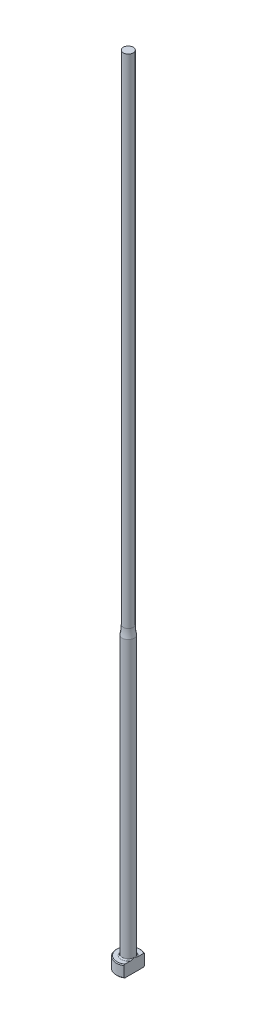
ISO-10303-21;
HEADER;
FILE_DESCRIPTION(('STEP AP214'),'2;1');
FILE_NAME('part.step','',(''),(''),'','','');
FILE_SCHEMA(('AUTOMOTIVE_DESIGN { 1 0 10303 214 1 1 1 1 }'));
ENDSEC;
DATA;
#1=APPLICATION_CONTEXT('core data for automotive mechanical design processes');
#2=APPLICATION_PROTOCOL_DEFINITION('international standard','automotive_design',2000,#1);
#3=PRODUCT_CONTEXT('',#1,'mechanical');
#4=PRODUCT('Part','Part','',(#3));
#5=PRODUCT_RELATED_PRODUCT_CATEGORY('part','',(#4));
#6=PRODUCT_DEFINITION_FORMATION('','',#4);
#7=PRODUCT_DEFINITION_CONTEXT('part definition',#1,'design');
#8=PRODUCT_DEFINITION('design','',#6,#7);
#9=PRODUCT_DEFINITION_SHAPE('','',#8);
#10=(LENGTH_UNIT() NAMED_UNIT(*) SI_UNIT(.MILLI.,.METRE.));
#11=(NAMED_UNIT(*) PLANE_ANGLE_UNIT() SI_UNIT($,.RADIAN.));
#12=(NAMED_UNIT(*) SI_UNIT($,.STERADIAN.) SOLID_ANGLE_UNIT());
#13=UNCERTAINTY_MEASURE_WITH_UNIT(LENGTH_MEASURE(1.E-05),#10,'distance_accuracy_value','');
#14=(GEOMETRIC_REPRESENTATION_CONTEXT(3) GLOBAL_UNCERTAINTY_ASSIGNED_CONTEXT((#13)) GLOBAL_UNIT_ASSIGNED_CONTEXT((#10,
#11,#12)) REPRESENTATION_CONTEXT('',''));
#15=CARTESIAN_POINT('',(0.,0.,0.));
#16=DIRECTION('',(0.,0.,1.));
#17=DIRECTION('',(1.,0.,0.));
#18=AXIS2_PLACEMENT_3D('',#15,#16,#17);
#19=CARTESIAN_POINT('',(-2.99999999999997,3.,0.));
#20=DIRECTION('',(0.,1.,0.));
#21=DIRECTION('',(0.,0.,1.));
#22=AXIS2_PLACEMENT_3D('',#19,#20,#21);
#23=PLANE('',#22);
#24=CARTESIAN_POINT('',(0.,3.,0.));
#25=DIRECTION('',(0.,1.,0.));
#26=DIRECTION('',(0.,0.,1.));
#27=AXIS2_PLACEMENT_3D('',#24,#25,#26);
#28=CIRCLE('',#27,2.79999999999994);
#29=CARTESIAN_POINT('',(1.49999999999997,3.,-2.36431808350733));
#30=VERTEX_POINT('',#29);
#31=CARTESIAN_POINT('',(1.49999999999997,3.,2.36431808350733));
#32=VERTEX_POINT('',#31);
#33=EDGE_CURVE('E187',#30,#32,#28,.T.);
#34=ORIENTED_EDGE('',*,*,#33,.T.);
#35=DIRECTION('',(0.,0.,-1.));
#36=VECTOR('',#35,1.);
#37=CARTESIAN_POINT('',(1.49999999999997,3.,0.));
#38=LINE('',#37,#36);
#39=CARTESIAN_POINT('',(1.49999999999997,3.00000000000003,0.99498743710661));
#40=VERTEX_POINT('',#39);
#41=EDGE_CURVE('E57',#32,#40,#38,.T.);
#42=ORIENTED_EDGE('',*,*,#41,.T.);
#43=CARTESIAN_POINT('',(0.,3.,0.));
#44=DIRECTION('',(0.,1.,0.));
#45=DIRECTION('',(0.,0.,1.));
#46=AXIS2_PLACEMENT_3D('',#43,#44,#45);
#47=CIRCLE('',#46,1.79999999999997);
#48=CARTESIAN_POINT('',(1.49999999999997,3.00000000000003,-0.994987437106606));
#49=VERTEX_POINT('',#48);
#50=EDGE_CURVE('E108',#40,#49,#47,.F.);
#51=ORIENTED_EDGE('',*,*,#50,.T.);
#52=EDGE_CURVE('E137',#49,#30,#38,.T.);
#53=ORIENTED_EDGE('',*,*,#52,.T.);
#54=EDGE_LOOP('',(#34,#42,#51,#53));
#55=FACE_BOUND('',#54,.T.);
#56=ADVANCED_FACE('F32',(#55),#23,.T.);
#57=CARTESIAN_POINT('',(0.,259.958771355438,0.));
#58=DIRECTION('',(0.,1.,0.));
#59=DIRECTION('',(0.,0.,1.));
#60=AXIS2_PLACEMENT_3D('',#57,#58,#59);
#61=CYLINDRICAL_SURFACE('',#60,2.99999999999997);
#62=CARTESIAN_POINT('',(0.,2.79999999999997,0.));
#63=DIRECTION('',(0.,1.,0.));
#64=DIRECTION('',(0.,0.,1.));
#65=AXIS2_PLACEMENT_3D('',#62,#63,#64);
#66=CIRCLE('',#65,2.99999999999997);
#67=CARTESIAN_POINT('',(1.49999999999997,2.79999999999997,2.5980762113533));
#68=VERTEX_POINT('',#67);
#69=CARTESIAN_POINT('',(1.49999999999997,2.79999999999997,-2.5980762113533));
#70=VERTEX_POINT('',#69);
#71=EDGE_CURVE('E105',#68,#70,#66,.F.);
#72=ORIENTED_EDGE('',*,*,#71,.T.);
#73=DIRECTION('',(0.,-1.,0.));
#74=VECTOR('',#73,1.);
#75=CARTESIAN_POINT('',(1.49999999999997,200.,-2.5980762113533));
#76=LINE('',#75,#74);
#77=CARTESIAN_POINT('',(1.49999999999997,0.200000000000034,-2.5980762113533));
#78=VERTEX_POINT('',#77);
#79=EDGE_CURVE('E193',#70,#78,#76,.T.);
#80=ORIENTED_EDGE('',*,*,#79,.T.);
#81=CARTESIAN_POINT('',(0.,0.200000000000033,0.));
#82=DIRECTION('',(0.,-1.,0.));
#83=DIRECTION('',(0.,0.,-1.));
#84=AXIS2_PLACEMENT_3D('',#81,#82,#83);
#85=CIRCLE('',#84,2.99999999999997);
#86=CARTESIAN_POINT('',(1.49999999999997,0.200000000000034,2.5980762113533));
#87=VERTEX_POINT('',#86);
#88=EDGE_CURVE('E100',#78,#87,#85,.F.);
#89=ORIENTED_EDGE('',*,*,#88,.T.);
#90=DIRECTION('',(0.,-1.,0.));
#91=VECTOR('',#90,1.);
#92=CARTESIAN_POINT('',(1.49999999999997,200.,2.5980762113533));
#93=LINE('',#92,#91);
#94=EDGE_CURVE('E93',#68,#87,#93,.T.);
#95=ORIENTED_EDGE('',*,*,#94,.F.);
#96=EDGE_LOOP('',(#72,#80,#89,#95));
#97=FACE_BOUND('',#96,.T.);
#98=ADVANCED_FACE('F158',(#97),#61,.T.);
#99=CARTESIAN_POINT('',(0.,0.,0.));
#100=DIRECTION('',(0.,-1.,0.));
#101=DIRECTION('',(0.,0.,-1.));
#102=AXIS2_PLACEMENT_3D('',#99,#100,#101);
#103=PLANE('',#102);
#104=CARTESIAN_POINT('',(0.,0.,0.));
#105=DIRECTION('',(0.,-1.,0.));
#106=DIRECTION('',(0.,0.,-1.));
#107=AXIS2_PLACEMENT_3D('',#104,#105,#106);
#108=CIRCLE('',#107,2.79999999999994);
#109=CARTESIAN_POINT('',(1.49999999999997,0.,2.36431808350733));
#110=VERTEX_POINT('',#109);
#111=CARTESIAN_POINT('',(1.49999999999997,0.,-2.36431808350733));
#112=VERTEX_POINT('',#111);
#113=EDGE_CURVE('E98',#110,#112,#108,.T.);
#114=ORIENTED_EDGE('',*,*,#113,.T.);
#115=DIRECTION('',(0.,0.,1.));
#116=VECTOR('',#115,1.);
#117=CARTESIAN_POINT('',(1.49999999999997,0.,-2.5980762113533));
#118=LINE('',#117,#116);
#119=EDGE_CURVE('E83',#112,#110,#118,.T.);
#120=ORIENTED_EDGE('',*,*,#119,.T.);
#121=EDGE_LOOP('',(#114,#120));
#122=FACE_BOUND('',#121,.T.);
#123=ADVANCED_FACE('F103',(#122),#103,.T.);
#124=CARTESIAN_POINT('',(0.,3.,0.));
#125=DIRECTION('',(0.,-1.,0.));
#126=DIRECTION('',(0.,0.,-1.));
#127=AXIS2_PLACEMENT_3D('',#124,#125,#126);
#128=CONICAL_SURFACE('',#127,2.79999999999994,0.785398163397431);
#129=ORIENTED_EDGE('',*,*,#71,.F.);
#130=CARTESIAN_POINT('',(1.49999999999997,-0.11174109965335,5.71827621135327));
#131=CARTESIAN_POINT('',(1.49999999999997,0.0136183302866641,5.58866816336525));
#132=CARTESIAN_POINT('',(1.49999999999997,0.138843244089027,5.45892957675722));
#133=CARTESIAN_POINT('',(1.49999999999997,0.388944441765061,5.19911365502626));
#134=CARTESIAN_POINT('',(1.49999999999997,0.513820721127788,5.06903631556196));
#135=CARTESIAN_POINT('',(1.49999999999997,0.763205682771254,4.80840180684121));
#136=CARTESIAN_POINT('',(1.49999999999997,0.887714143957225,4.67784442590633));
#137=CARTESIAN_POINT('',(1.49999999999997,1.13618059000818,4.4162081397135));
#138=CARTESIAN_POINT('',(1.49999999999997,1.26013857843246,4.28512923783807));
#139=CARTESIAN_POINT('',(1.49999999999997,1.50488975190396,4.02490837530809));
#140=CARTESIAN_POINT('',(1.49999999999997,1.62569693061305,3.8957795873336));
#141=CARTESIAN_POINT('',(1.49999999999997,1.86640694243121,3.63668213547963));
#142=CARTESIAN_POINT('',(1.49999999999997,1.98630978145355,3.50671347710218));
#143=CARTESIAN_POINT('',(1.49999999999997,2.2248603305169,3.24567921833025));
#144=CARTESIAN_POINT('',(1.49999999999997,2.3435083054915,3.11461386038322));
#145=CARTESIAN_POINT('',(1.49999999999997,2.5790771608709,2.85094268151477));
#146=CARTESIAN_POINT('',(1.49999999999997,2.69599811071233,2.71833692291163));
#147=CARTESIAN_POINT('',(1.49999999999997,2.88262371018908,2.50255231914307));
#148=CARTESIAN_POINT('',(1.49999999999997,2.95312454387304,2.42006293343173));
#149=CARTESIAN_POINT('',(1.49999999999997,3.09287098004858,2.25401084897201));
#150=CARTESIAN_POINT('',(1.49999999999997,3.16211645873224,2.17044804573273));
#151=CARTESIAN_POINT('',(1.49999999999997,3.29964684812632,2.00105967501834));
#152=CARTESIAN_POINT('',(1.49999999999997,3.36791386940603,1.9152195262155));
#153=CARTESIAN_POINT('',(1.49999999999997,3.50205840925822,1.7417139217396));
#154=CARTESIAN_POINT('',(1.49999999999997,3.56793649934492,1.65404891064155));
#155=CARTESIAN_POINT('',(1.49999999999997,3.69728151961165,1.47490236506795));
#156=CARTESIAN_POINT('',(1.49999999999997,3.76069661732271,1.38338308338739));
#157=CARTESIAN_POINT('',(1.49999999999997,3.88239539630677,1.19675661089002));
#158=CARTESIAN_POINT('',(1.49999999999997,3.94067201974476,1.10164473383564));
#159=CARTESIAN_POINT('',(1.49999999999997,4.048413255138,0.908008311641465));
#160=CARTESIAN_POINT('',(1.49999999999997,4.09797809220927,0.809540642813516));
#161=CARTESIAN_POINT('',(1.49999999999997,4.18432188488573,0.60719295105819));
#162=CARTESIAN_POINT('',(1.49999999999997,4.22114374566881,0.503332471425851));
#163=CARTESIAN_POINT('',(1.49999999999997,4.26099935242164,0.3475775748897));
#164=CARTESIAN_POINT('',(1.49999999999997,4.2715702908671,0.297609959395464));
#165=CARTESIAN_POINT('',(1.49999999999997,4.28794860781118,0.196885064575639));
#166=CARTESIAN_POINT('',(1.49999999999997,4.29375640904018,0.146127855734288));
#167=CARTESIAN_POINT('',(1.49999999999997,4.30019707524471,0.0444388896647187));
#168=CARTESIAN_POINT('',(1.49999999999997,4.30084594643,-0.00649183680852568));
#169=CARTESIAN_POINT('',(1.49999999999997,4.29696416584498,-0.108155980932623));
#170=CARTESIAN_POINT('',(1.49999999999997,4.29243308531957,-0.158889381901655));
#171=CARTESIAN_POINT('',(1.49999999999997,4.27856915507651,-0.259234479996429));
#172=CARTESIAN_POINT('',(1.49999999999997,4.2692782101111,-0.308852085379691));
#173=CARTESIAN_POINT('',(1.49999999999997,4.24647108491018,-0.407110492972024));
#174=CARTESIAN_POINT('',(1.49999999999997,4.23295324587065,-0.45575090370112));
#175=CARTESIAN_POINT('',(1.49999999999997,4.20226175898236,-0.55214996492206));
#176=CARTESIAN_POINT('',(1.49999999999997,4.18506801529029,-0.599902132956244));
#177=CARTESIAN_POINT('',(1.49999999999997,4.14771387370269,-0.694205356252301));
#178=CARTESIAN_POINT('',(1.49999999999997,4.12755408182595,-0.740756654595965));
#179=CARTESIAN_POINT('',(1.49999999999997,4.0632769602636,-0.879166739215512));
#180=CARTESIAN_POINT('',(1.49999999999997,4.01551721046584,-0.969329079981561));
#181=CARTESIAN_POINT('',(1.49999999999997,3.91367909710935,-1.14604316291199));
#182=CARTESIAN_POINT('',(1.49999999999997,3.85959300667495,-1.2325903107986));
#183=CARTESIAN_POINT('',(1.49999999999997,3.74697968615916,-1.40321348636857));
#184=CARTESIAN_POINT('',(1.49999999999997,3.68843573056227,-1.4872783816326));
#185=CARTESIAN_POINT('',(1.49999999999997,3.5684384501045,-1.65322187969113));
#186=CARTESIAN_POINT('',(1.49999999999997,3.50698656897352,-1.73510153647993));
#187=CARTESIAN_POINT('',(1.49999999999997,3.3811567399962,-1.89829823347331));
#188=CARTESIAN_POINT('',(1.49999999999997,3.31675092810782,-1.97959369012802));
#189=CARTESIAN_POINT('',(1.49999999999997,3.18634068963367,-2.14090082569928));
#190=CARTESIAN_POINT('',(1.49999999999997,3.12033609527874,-2.22091236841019));
#191=CARTESIAN_POINT('',(1.49999999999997,2.92086431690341,-2.45906508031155));
#192=CARTESIAN_POINT('',(1.49999999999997,2.78562663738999,-2.61572090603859));
#193=CARTESIAN_POINT('',(1.49999999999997,2.53554498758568,-2.90006295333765));
#194=CARTESIAN_POINT('',(1.49999999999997,2.42114543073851,-3.02814382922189));
#195=CARTESIAN_POINT('',(1.49999999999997,2.1909355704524,-3.28303767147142));
#196=CARTESIAN_POINT('',(1.49999999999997,2.07512522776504,-3.40985060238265));
#197=CARTESIAN_POINT('',(1.49999999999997,1.72597067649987,-3.78913849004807));
#198=CARTESIAN_POINT('',(1.49999999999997,1.49111760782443,-4.04022177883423));
#199=CARTESIAN_POINT('',(1.49999999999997,1.0288247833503,-4.52992803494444));
#200=CARTESIAN_POINT('',(1.49999999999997,0.801477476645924,-4.76863870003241));
#201=CARTESIAN_POINT('',(1.49999999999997,0.459548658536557,-5.12558036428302));
#202=CARTESIAN_POINT('',(1.49999999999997,0.345484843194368,-5.24430773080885));
#203=CARTESIAN_POINT('',(1.49999999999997,0.117071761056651,-5.48148573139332));
#204=CARTESIAN_POINT('',(1.49999999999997,0.00272249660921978,-5.59993636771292));
#205=CARTESIAN_POINT('',(1.49999999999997,-0.11174109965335,-5.71827621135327));
#206=B_SPLINE_CURVE_WITH_KNOTS('',3,(#130,#131,#132,#133,#134,#135,#136,#137,#138,#139,#140,
#141,#142,#143,#144,#145,#146,#147,#148,#149,#150,#151,#152,#153,#154,#155,#156,#157,#158,#159,
#160,#161,#162,#163,#164,#165,#166,#167,#168,#169,#170,#171,#172,#173,#174,#175,#176,#177,#178,
#179,#180,#181,#182,#183,#184,#185,#186,#187,#188,#189,#190,#191,#192,#193,#194,#195,#196,#197,
#198,#199,#200,#201,#202,#203,#204,#205),.UNSPECIFIED.,.F.,.F.,(4,2,2,2,2,2,2,2,2,2,2,2,2,2,2,2,
2,2,2,2,2,2,2,2,2,2,2,2,2,2,2,2,2,2,2,2,2,4),(0.,0.540943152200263,1.08189327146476,
1.62312052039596,2.16434426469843,2.69482920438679,3.22531067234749,3.75567781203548,
4.28602356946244,4.61155053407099,4.9371094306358,5.26610945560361,5.59503024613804,
5.92894782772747,6.26331713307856,6.59354403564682,6.92264800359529,7.07567478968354,
7.2286879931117,7.38122626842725,7.53377717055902,7.6850075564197,7.83629736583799,
7.98843643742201,8.14054446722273,8.44618799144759,8.75220879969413,9.05944044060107,
9.3665211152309,9.6776428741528,9.98879742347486,10.609592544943,11.1247803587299,
11.6399825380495,12.6713544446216,13.6603005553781,14.1542238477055,14.6481430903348),.UNSPECIFIED.);
#207=EDGE_CURVE('E136',#68,#32,#206,.T.);
#208=ORIENTED_EDGE('',*,*,#207,.T.);
#209=ORIENTED_EDGE('',*,*,#33,.F.);
#210=EDGE_CURVE('E128',#30,#70,#206,.T.);
#211=ORIENTED_EDGE('',*,*,#210,.T.);
#212=EDGE_LOOP('',(#129,#208,#209,#211));
#213=FACE_BOUND('',#212,.T.);
#214=ADVANCED_FACE('F144',(#213),#128,.T.);
#215=CARTESIAN_POINT('',(0.,0.200000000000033,0.));
#216=DIRECTION('',(0.,1.,0.));
#217=DIRECTION('',(0.,0.,1.));
#218=AXIS2_PLACEMENT_3D('',#215,#216,#217);
#219=CONICAL_SURFACE('',#218,2.99999999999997,0.785398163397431);
#220=ORIENTED_EDGE('',*,*,#88,.F.);
#221=CARTESIAN_POINT('',(1.49999999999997,3.11174109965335,-5.71827621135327));
#222=CARTESIAN_POINT('',(1.49999999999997,2.98638166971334,-5.58866816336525));
#223=CARTESIAN_POINT('',(1.49999999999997,2.86115675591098,-5.45892957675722));
#224=CARTESIAN_POINT('',(1.49999999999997,2.61105555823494,-5.19911365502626));
#225=CARTESIAN_POINT('',(1.49999999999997,2.48617927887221,-5.06903631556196));
#226=CARTESIAN_POINT('',(1.49999999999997,2.23679431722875,-4.80840180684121));
#227=CARTESIAN_POINT('',(1.49999999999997,2.11228585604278,-4.67784442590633));
#228=CARTESIAN_POINT('',(1.49999999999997,1.86381940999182,-4.4162081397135));
#229=CARTESIAN_POINT('',(1.49999999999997,1.73986142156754,-4.28512923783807));
#230=CARTESIAN_POINT('',(1.49999999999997,1.49511024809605,-4.02490837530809));
#231=CARTESIAN_POINT('',(1.49999999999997,1.37430306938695,-3.8957795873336));
#232=CARTESIAN_POINT('',(1.49999999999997,1.13359305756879,-3.63668213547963));
#233=CARTESIAN_POINT('',(1.49999999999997,1.01369021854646,-3.50671347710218));
#234=CARTESIAN_POINT('',(1.49999999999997,0.775139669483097,-3.24567921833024));
#235=CARTESIAN_POINT('',(1.49999999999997,0.656491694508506,-3.11461386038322));
#236=CARTESIAN_POINT('',(1.49999999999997,0.420922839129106,-2.85094268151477));
#237=CARTESIAN_POINT('',(1.49999999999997,0.304001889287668,-2.71833692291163));
#238=CARTESIAN_POINT('',(1.49999999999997,0.117376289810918,-2.50255231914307));
#239=CARTESIAN_POINT('',(1.49999999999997,0.0468754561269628,-2.42006293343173));
#240=CARTESIAN_POINT('',(1.49999999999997,-0.0928709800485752,-2.254010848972));
#241=CARTESIAN_POINT('',(1.49999999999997,-0.162116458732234,-2.17044804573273));
#242=CARTESIAN_POINT('',(1.49999999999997,-0.299646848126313,-2.00105967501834));
#243=CARTESIAN_POINT('',(1.49999999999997,-0.367913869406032,-1.9152195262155));
#244=CARTESIAN_POINT('',(1.49999999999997,-0.502058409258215,-1.7417139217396));
#245=CARTESIAN_POINT('',(1.49999999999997,-0.567936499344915,-1.65404891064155));
#246=CARTESIAN_POINT('',(1.49999999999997,-0.697281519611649,-1.47490236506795));
#247=CARTESIAN_POINT('',(1.49999999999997,-0.760696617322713,-1.38338308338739));
#248=CARTESIAN_POINT('',(1.49999999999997,-0.882395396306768,-1.19675661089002));
#249=CARTESIAN_POINT('',(1.49999999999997,-0.940672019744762,-1.10164473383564));
#250=CARTESIAN_POINT('',(1.49999999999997,-1.04841325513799,-0.908008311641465));
#251=CARTESIAN_POINT('',(1.49999999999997,-1.09797809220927,-0.809540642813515));
#252=CARTESIAN_POINT('',(1.49999999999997,-1.18432188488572,-0.607192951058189));
#253=CARTESIAN_POINT('',(1.49999999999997,-1.22114374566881,-0.503332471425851));
#254=CARTESIAN_POINT('',(1.49999999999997,-1.26099935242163,-0.3475775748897));
#255=CARTESIAN_POINT('',(1.49999999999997,-1.2715702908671,-0.297609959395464));
#256=CARTESIAN_POINT('',(1.49999999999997,-1.28794860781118,-0.19688506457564));
#257=CARTESIAN_POINT('',(1.49999999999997,-1.29375640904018,-0.146127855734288));
#258=CARTESIAN_POINT('',(1.49999999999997,-1.30019707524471,-0.0444388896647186));
#259=CARTESIAN_POINT('',(1.49999999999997,-1.30084594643,0.00649183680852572));
#260=CARTESIAN_POINT('',(1.49999999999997,-1.29696416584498,0.108155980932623));
#261=CARTESIAN_POINT('',(1.49999999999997,-1.29243308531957,0.158889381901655));
#262=CARTESIAN_POINT('',(1.49999999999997,-1.2785691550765,0.259234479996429));
#263=CARTESIAN_POINT('',(1.49999999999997,-1.2692782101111,0.308852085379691));
#264=CARTESIAN_POINT('',(1.49999999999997,-1.24647108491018,0.407110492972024));
#265=CARTESIAN_POINT('',(1.49999999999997,-1.23295324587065,0.45575090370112));
#266=CARTESIAN_POINT('',(1.49999999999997,-1.20226175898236,0.55214996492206));
#267=CARTESIAN_POINT('',(1.49999999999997,-1.18506801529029,0.599902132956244));
#268=CARTESIAN_POINT('',(1.49999999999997,-1.14771387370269,0.694205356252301));
#269=CARTESIAN_POINT('',(1.49999999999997,-1.12755408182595,0.740756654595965));
#270=CARTESIAN_POINT('',(1.49999999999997,-1.0632769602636,0.879166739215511));
#271=CARTESIAN_POINT('',(1.49999999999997,-1.01551721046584,0.96932907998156));
#272=CARTESIAN_POINT('',(1.49999999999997,-0.913679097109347,1.14604316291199));
#273=CARTESIAN_POINT('',(1.49999999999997,-0.85959300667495,1.2325903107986));
#274=CARTESIAN_POINT('',(1.49999999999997,-0.74697968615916,1.40321348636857));
#275=CARTESIAN_POINT('',(1.49999999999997,-0.688435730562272,1.4872783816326));
#276=CARTESIAN_POINT('',(1.49999999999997,-0.568438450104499,1.65322187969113));
#277=CARTESIAN_POINT('',(1.49999999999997,-0.50698656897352,1.73510153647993));
#278=CARTESIAN_POINT('',(1.49999999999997,-0.381156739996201,1.89829823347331));
#279=CARTESIAN_POINT('',(1.49999999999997,-0.316750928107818,1.97959369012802));
#280=CARTESIAN_POINT('',(1.49999999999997,-0.186340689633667,2.14090082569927));
#281=CARTESIAN_POINT('',(1.49999999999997,-0.120336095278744,2.22091236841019));
#282=CARTESIAN_POINT('',(1.49999999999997,0.0791356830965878,2.45906508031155));
#283=CARTESIAN_POINT('',(1.49999999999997,0.214373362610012,2.61572090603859));
#284=CARTESIAN_POINT('',(1.49999999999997,0.464455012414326,2.90006295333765));
#285=CARTESIAN_POINT('',(1.49999999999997,0.578854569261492,3.02814382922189));
#286=CARTESIAN_POINT('',(1.49999999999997,0.809064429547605,3.28303767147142));
#287=CARTESIAN_POINT('',(1.49999999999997,0.924874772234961,3.40985060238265));
#288=CARTESIAN_POINT('',(1.49999999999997,1.27402932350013,3.78913849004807));
#289=CARTESIAN_POINT('',(1.49999999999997,1.50888239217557,4.04022177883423));
#290=CARTESIAN_POINT('',(1.49999999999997,1.97117521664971,4.52992803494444));
#291=CARTESIAN_POINT('',(1.49999999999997,2.19852252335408,4.76863870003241));
#292=CARTESIAN_POINT('',(1.49999999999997,2.54045134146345,5.12558036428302));
#293=CARTESIAN_POINT('',(1.49999999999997,2.65451515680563,5.24430773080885));
#294=CARTESIAN_POINT('',(1.49999999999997,2.88292823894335,5.48148573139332));
#295=CARTESIAN_POINT('',(1.49999999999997,2.99727750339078,5.59993636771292));
#296=CARTESIAN_POINT('',(1.49999999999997,3.11174109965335,5.71827621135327));
#297=B_SPLINE_CURVE_WITH_KNOTS('',3,(#221,#222,#223,#224,#225,#226,#227,#228,#229,#230,#231,
#232,#233,#234,#235,#236,#237,#238,#239,#240,#241,#242,#243,#244,#245,#246,#247,#248,#249,#250,
#251,#252,#253,#254,#255,#256,#257,#258,#259,#260,#261,#262,#263,#264,#265,#266,#267,#268,#269,
#270,#271,#272,#273,#274,#275,#276,#277,#278,#279,#280,#281,#282,#283,#284,#285,#286,#287,#288,
#289,#290,#291,#292,#293,#294,#295,#296),.UNSPECIFIED.,.F.,.F.,(4,2,2,2,2,2,2,2,2,2,2,2,2,2,2,2,
2,2,2,2,2,2,2,2,2,2,2,2,2,2,2,2,2,2,2,2,2,4),(0.,0.540943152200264,1.08189327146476,
1.62312052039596,2.16434426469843,2.69482920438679,3.22531067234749,3.75567781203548,
4.28602356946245,4.611550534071,4.9371094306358,5.26610945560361,5.59503024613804,
5.92894782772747,6.26331713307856,6.59354403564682,6.92264800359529,7.07567478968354,
7.2286879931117,7.38122626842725,7.53377717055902,7.6850075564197,7.83629736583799,
7.98843643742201,8.14054446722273,8.44618799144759,8.75220879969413,9.05944044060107,
9.3665211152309,9.6776428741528,9.98879742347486,10.609592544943,11.1247803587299,
11.6399825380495,12.6713544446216,13.6603005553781,14.1542238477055,14.6481430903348),.UNSPECIFIED.);
#298=EDGE_CURVE('E86',#78,#112,#297,.T.);
#299=ORIENTED_EDGE('',*,*,#298,.T.);
#300=ORIENTED_EDGE('',*,*,#113,.F.);
#301=EDGE_CURVE('E89',#110,#87,#297,.T.);
#302=ORIENTED_EDGE('',*,*,#301,.T.);
#303=EDGE_LOOP('',(#220,#299,#300,#302));
#304=FACE_BOUND('',#303,.T.);
#305=ADVANCED_FACE('F97',(#304),#219,.T.);
#306=CARTESIAN_POINT('',(0.,3.30000000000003,0.));
#307=DIRECTION('',(0.,1.,0.));
#308=DIRECTION('',(0.,0.,1.));
#309=AXIS2_PLACEMENT_3D('',#306,#307,#308);
#310=TOROIDAL_SURFACE('',#309,1.79999999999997,0.3);
#311=CARTESIAN_POINT('',(1.49999999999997,3.30000000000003,0.));
#312=CARTESIAN_POINT('',(1.49999999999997,3.300000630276,3.41555678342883E-12));
#313=CARTESIAN_POINT('',(1.49999999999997,3.30000126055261,-1.15373640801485E-07));
#314=CARTESIAN_POINT('',(1.49999999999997,3.3000024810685,-4.90631575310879E-07));
#315=CARTESIAN_POINT('',(1.49999999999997,3.30000307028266,-7.53296670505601E-07));
#316=CARTESIAN_POINT('',(1.49999999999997,3.30000424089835,-1.38757096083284E-06));
#317=CARTESIAN_POINT('',(1.49999999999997,3.300004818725,-1.76563001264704E-06));
#318=CARTESIAN_POINT('',(1.49999999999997,3.30000591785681,-2.58768006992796E-06));
#319=CARTESIAN_POINT('',(1.49999999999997,3.30000643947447,-3.03127014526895E-06));
#320=CARTESIAN_POINT('',(1.49999999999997,3.30000815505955,-4.60021967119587E-06));
#321=CARTESIAN_POINT('',(1.49999999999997,3.30000927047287,-5.8124152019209E-06));
#322=CARTESIAN_POINT('',(1.49999999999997,3.30001128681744,-8.33989413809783E-06));
#323=CARTESIAN_POINT('',(1.49999999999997,3.30001219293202,-9.65128157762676E-06));
#324=CARTESIAN_POINT('',(1.49999999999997,3.30001551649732,-1.46782505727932E-05));
#325=CARTESIAN_POINT('',(1.49999999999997,3.30001775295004,-1.8517976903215E-05));
#326=CARTESIAN_POINT('',(1.49999999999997,3.30002148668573,-2.61616194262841E-05));
#327=CARTESIAN_POINT('',(1.49999999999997,3.30002302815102,-2.99447742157E-05));
#328=CARTESIAN_POINT('',(1.49999999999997,3.30002943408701,-4.58003743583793E-05));
#329=CARTESIAN_POINT('',(1.49999999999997,3.3000341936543,-5.79079078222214E-05));
#330=CARTESIAN_POINT('',(1.49999999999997,3.30004197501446,-8.07263755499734E-05));
#331=CARTESIAN_POINT('',(1.49999999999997,3.30004514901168,-9.13834709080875E-05));
#332=CARTESIAN_POINT('',(1.49999999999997,3.30006989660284,-0.000167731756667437));
#333=CARTESIAN_POINT('',(1.49999999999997,3.30010092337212,-0.000229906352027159));
#334=CARTESIAN_POINT('',(1.49999999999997,3.30021632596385,-0.000470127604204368));
#335=CARTESIAN_POINT('',(1.49999999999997,3.30029368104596,-0.000650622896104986));
#336=CARTESIAN_POINT('',(1.49999999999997,3.30059619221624,-0.00134589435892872));
#337=CARTESIAN_POINT('',(1.49999999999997,3.30082870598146,-0.00185814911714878));
#338=CARTESIAN_POINT('',(1.49999999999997,3.30176696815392,-0.00393547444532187));
#339=CARTESIAN_POINT('',(1.49999999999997,3.30246445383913,-0.00550332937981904));
#340=CARTESIAN_POINT('',(1.49999999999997,3.31426785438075,-0.0320229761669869));
#341=CARTESIAN_POINT('',(1.49999999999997,3.32544800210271,-0.0569503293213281));
#342=CARTESIAN_POINT('',(1.49999999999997,3.34725700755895,-0.105984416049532));
#343=CARTESIAN_POINT('',(1.49999999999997,3.35789134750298,-0.130088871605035));
#344=CARTESIAN_POINT('',(1.49999999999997,3.38015321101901,-0.181096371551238));
#345=CARTESIAN_POINT('',(1.49999999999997,3.39175804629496,-0.208009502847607));
#346=CARTESIAN_POINT('',(1.49999999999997,3.41469034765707,-0.262264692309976));
#347=CARTESIAN_POINT('',(1.49999999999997,3.42601398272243,-0.289608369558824));
#348=CARTESIAN_POINT('',(1.49999999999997,3.45363212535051,-0.35820378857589));
#349=CARTESIAN_POINT('',(1.49999999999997,3.46959026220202,-0.39959288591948));
#350=CARTESIAN_POINT('',(1.49999999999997,3.49940505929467,-0.482097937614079));
#351=CARTESIAN_POINT('',(1.49999999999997,3.51330033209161,-0.523199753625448));
#352=CARTESIAN_POINT('',(1.49999999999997,3.53552507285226,-0.595497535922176));
#353=CARTESIAN_POINT('',(1.49999999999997,3.54436834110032,-0.626532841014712));
#354=CARTESIAN_POINT('',(1.49999999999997,3.56052427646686,-0.6891760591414));
#355=CARTESIAN_POINT('',(1.49999999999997,3.5678279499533,-0.720786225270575));
#356=CARTESIAN_POINT('',(1.49999999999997,3.5875075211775,-0.819524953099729));
#357=CARTESIAN_POINT('',(1.49999999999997,3.59661044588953,-0.88742909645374));
#358=CARTESIAN_POINT('',(1.49999999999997,3.60059842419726,-0.991180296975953));
#359=CARTESIAN_POINT('',(1.49999999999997,3.60019840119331,-1.02684364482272));
#360=CARTESIAN_POINT('',(1.49999999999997,3.59497085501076,-1.097505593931));
#361=CARTESIAN_POINT('',(1.49999999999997,3.59019295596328,-1.13250716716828));
#362=CARTESIAN_POINT('',(1.49999999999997,3.57687734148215,-1.19353096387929));
#363=CARTESIAN_POINT('',(1.49999999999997,3.56943875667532,-1.21978854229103));
#364=CARTESIAN_POINT('',(1.49999999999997,3.55063748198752,-1.27094658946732));
#365=CARTESIAN_POINT('',(1.49999999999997,3.53927342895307,-1.29584658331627));
#366=CARTESIAN_POINT('',(1.49999999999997,3.51660016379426,-1.33501873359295));
#367=CARTESIAN_POINT('',(1.49999999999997,3.50657738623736,-1.35003296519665));
#368=CARTESIAN_POINT('',(1.49999999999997,3.48437469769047,-1.37837252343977));
#369=CARTESIAN_POINT('',(1.49999999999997,3.47219867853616,-1.39170082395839));
#370=CARTESIAN_POINT('',(1.49999999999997,3.44835614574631,-1.41349417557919));
#371=CARTESIAN_POINT('',(1.49999999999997,3.43709185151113,-1.42239673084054));
#372=CARTESIAN_POINT('',(1.49999999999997,3.41325256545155,-1.43825467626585));
#373=CARTESIAN_POINT('',(1.49999999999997,3.40067804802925,-1.44521076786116));
#374=CARTESIAN_POINT('',(1.49999999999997,3.37433767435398,-1.45677158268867));
#375=CARTESIAN_POINT('',(1.49999999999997,3.36056203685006,-1.46135438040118));
#376=CARTESIAN_POINT('',(1.49999999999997,3.33237324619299,-1.46767730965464));
#377=CARTESIAN_POINT('',(1.49999999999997,3.31796076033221,-1.46942034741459));
#378=CARTESIAN_POINT('',(1.49999999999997,3.29122479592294,-1.4698720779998));
#379=CARTESIAN_POINT('',(1.49999999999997,3.27890664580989,-1.468990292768));
#380=CARTESIAN_POINT('',(1.49999999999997,3.25461019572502,-1.4651157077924));
#381=CARTESIAN_POINT('',(1.49999999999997,3.2426318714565,-1.46212305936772));
#382=CARTESIAN_POINT('',(1.49999999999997,3.21959683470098,-1.4543117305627));
#383=CARTESIAN_POINT('',(1.49999999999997,3.20852542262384,-1.44953579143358));
#384=CARTESIAN_POINT('',(1.49999999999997,3.18721125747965,-1.43840957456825));
#385=CARTESIAN_POINT('',(1.49999999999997,3.1769687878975,-1.43205876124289));
#386=CARTESIAN_POINT('',(1.49999999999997,3.15325976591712,-1.41506353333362));
#387=CARTESIAN_POINT('',(1.49999999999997,3.14027750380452,-1.40374235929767));
#388=CARTESIAN_POINT('',(1.49999999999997,3.11630720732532,-1.37914825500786));
#389=CARTESIAN_POINT('',(1.49999999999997,3.10532420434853,-1.36587054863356));
#390=CARTESIAN_POINT('',(1.49999999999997,3.08100891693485,-1.33197272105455));
#391=CARTESIAN_POINT('',(1.49999999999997,3.06867625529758,-1.31063843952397));
#392=CARTESIAN_POINT('',(1.49999999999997,3.04751867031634,-1.26637455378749));
#393=CARTESIAN_POINT('',(1.49999999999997,3.03869240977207,-1.24344556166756));
#394=CARTESIAN_POINT('',(1.49999999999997,3.01978360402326,-1.18316534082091));
#395=CARTESIAN_POINT('',(1.49999999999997,3.01191472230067,-1.14512623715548));
#396=CARTESIAN_POINT('',(1.49999999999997,3.00188285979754,-1.06789971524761));
#397=CARTESIAN_POINT('',(1.49999999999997,2.99979735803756,-1.02870374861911));
#398=CARTESIAN_POINT('',(1.49999999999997,3.00021727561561,-0.953160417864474));
#399=CARTESIAN_POINT('',(1.49999999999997,3.00240673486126,-0.916808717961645));
#400=CARTESIAN_POINT('',(1.49999999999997,3.0099643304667,-0.844432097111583));
#401=CARTESIAN_POINT('',(1.49999999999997,3.01533462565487,-0.808407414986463));
#402=CARTESIAN_POINT('',(1.49999999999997,3.02828086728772,-0.738670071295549));
#403=CARTESIAN_POINT('',(1.49999999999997,3.03573028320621,-0.704933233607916));
#404=CARTESIAN_POINT('',(1.49999999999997,3.05243174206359,-0.638128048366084));
#405=CARTESIAN_POINT('',(1.49999999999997,3.06167285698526,-0.605056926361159));
#406=CARTESIAN_POINT('',(1.49999999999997,3.08440652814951,-0.53019513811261));
#407=CARTESIAN_POINT('',(1.49999999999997,3.09836576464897,-0.488547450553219));
#408=CARTESIAN_POINT('',(1.49999999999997,3.1283820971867,-0.404954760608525));
#409=CARTESIAN_POINT('',(1.49999999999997,3.14447968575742,-0.363024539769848));
#410=CARTESIAN_POINT('',(1.49999999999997,3.17238454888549,-0.293508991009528));
#411=CARTESIAN_POINT('',(1.49999999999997,3.18384249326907,-0.265781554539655));
#412=CARTESIAN_POINT('',(1.49999999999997,3.20705854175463,-0.210769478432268));
#413=CARTESIAN_POINT('',(1.49999999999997,3.21881265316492,-0.183483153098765));
#414=CARTESIAN_POINT('',(1.49999999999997,3.24136702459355,-0.131772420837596));
#415=CARTESIAN_POINT('',(1.49999999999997,3.25214361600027,-0.107337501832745));
#416=CARTESIAN_POINT('',(1.49999999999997,3.27424746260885,-0.0576321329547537));
#417=CARTESIAN_POINT('',(1.49999999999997,3.28558038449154,-0.0323640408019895));
#418=CARTESIAN_POINT('',(1.49999999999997,3.29753556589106,-0.00550327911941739));
#419=CARTESIAN_POINT('',(1.49999999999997,3.29823307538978,-0.00393537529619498));
#420=CARTESIAN_POINT('',(1.49999999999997,3.29917134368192,-0.00185803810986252));
#421=CARTESIAN_POINT('',(1.49999999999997,3.29940384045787,-0.00134582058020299));
#422=CARTESIAN_POINT('',(1.49999999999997,3.29970633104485,-0.000650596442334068));
#423=CARTESIAN_POINT('',(1.49999999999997,3.29978368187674,-0.000470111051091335));
#424=CARTESIAN_POINT('',(1.49999999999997,3.29989907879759,-0.000229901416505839));
#425=CARTESIAN_POINT('',(1.49999999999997,3.29993010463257,-0.000167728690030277));
#426=CARTESIAN_POINT('',(1.49999999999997,3.29995485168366,-9.13825689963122E-05));
#427=CARTESIAN_POINT('',(1.49999999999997,3.29995802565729,-8.07256241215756E-05));
#428=CARTESIAN_POINT('',(1.49999999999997,3.29996580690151,-5.79074820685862E-05));
#429=CARTESIAN_POINT('',(1.49999999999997,3.29997056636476,-4.5800119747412E-05));
#430=CARTESIAN_POINT('',(1.49999999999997,3.29997697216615,-2.99447119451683E-05));
#431=CARTESIAN_POINT('',(1.49999999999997,3.2999785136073,-2.61615817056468E-05));
#432=CARTESIAN_POINT('',(1.49999999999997,3.2999822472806,-1.85179845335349E-05));
#433=CARTESIAN_POINT('',(1.49999999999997,3.29998448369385,-1.46782782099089E-05));
#434=CARTESIAN_POINT('',(1.49999999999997,3.2999878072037,-9.65132752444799E-06));
#435=CARTESIAN_POINT('',(1.49999999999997,3.299988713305,-8.33994202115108E-06));
#436=CARTESIAN_POINT('',(1.49999999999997,3.29999072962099,-5.81246426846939E-06));
#437=CARTESIAN_POINT('',(1.49999999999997,3.29999184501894,-4.600267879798E-06));
#438=CARTESIAN_POINT('',(1.49999999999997,3.29999356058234,-3.03131394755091E-06));
#439=CARTESIAN_POINT('',(1.49999999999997,3.29999408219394,-2.58772196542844E-06));
#440=CARTESIAN_POINT('',(1.49999999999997,3.2999951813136,-1.76566701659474E-06));
#441=CARTESIAN_POINT('',(1.49999999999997,3.29999575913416,-1.38760497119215E-06));
#442=CARTESIAN_POINT('',(1.49999999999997,3.29999692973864,-7.53323425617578E-07));
#443=CARTESIAN_POINT('',(1.49999999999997,3.29999751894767,-4.90654189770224E-07));
#444=CARTESIAN_POINT('',(1.49999999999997,3.29999873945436,-1.15386267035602E-07));
#445=CARTESIAN_POINT('',(1.49999999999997,3.29999936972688,-3.41554144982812E-12));
#446=CARTESIAN_POINT('',(1.49999999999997,3.30000000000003,0.));
#447=B_SPLINE_CURVE_WITH_KNOTS('',3,(#311,#312,#313,#314,#315,#316,#317,#318,#319,#320,#321,
#322,#323,#324,#325,#326,#327,#328,#329,#330,#331,#332,#333,#334,#335,#336,#337,#338,#339,#340,
#341,#342,#343,#344,#345,#346,#347,#348,#349,#350,#351,#352,#353,#354,#355,#356,#357,#358,#359,
#360,#361,#362,#363,#364,#365,#366,#367,#368,#369,#370,#371,#372,#373,#374,#375,#376,#377,#378,
#379,#380,#381,#382,#383,#384,#385,#386,#387,#388,#389,#390,#391,#392,#393,#394,#395,#396,#397,
#398,#399,#400,#401,#402,#403,#404,#405,#406,#407,#408,#409,#410,#411,#412,#413,#414,#415,#416,
#417,#418,#419,#420,#421,#422,#423,#424,#425,#426,#427,#428,#429,#430,#431,#432,#433,#434,#435,
#436,#437,#438,#439,#440,#441,#442,#443,#444,#445,#446),.UNSPECIFIED.,.T.,.F.,(4,2,2,2,2,2,2,2,
2,2,2,2,2,2,2,2,2,2,2,2,2,2,2,2,2,2,2,2,2,2,2,2,2,2,2,2,2,2,2,2,2,2,2,2,2,2,2,2,2,2,2,2,2,2,2,2,
2,2,2,2,2,2,2,2,2,2,2,4),(0.,1.88906036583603E-06,3.8150959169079E-06,5.87892837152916E-06,
7.93062024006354E-06,1.28480890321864E-05,1.76261717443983E-05,3.0909918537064E-05,
4.31529750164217E-05,8.21699329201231E-05,0.000115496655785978,0.000323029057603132,
0.000912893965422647,0.00259963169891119,0.00774858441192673,0.0896975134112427,
0.168737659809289,0.256660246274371,0.345444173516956,0.478492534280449,0.608603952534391,
0.705372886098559,0.802692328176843,1.00719557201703,1.11399616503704,1.21960092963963,
1.30124317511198,1.38291380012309,1.43690814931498,1.49080588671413,1.53371524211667,
1.57660911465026,1.61989249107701,1.66313154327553,1.69999492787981,1.73685567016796,
1.77288440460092,1.80892540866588,1.86031324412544,1.91182866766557,1.98534297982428,
2.05882922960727,2.1747172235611,2.29215041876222,2.40123170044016,2.51038710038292,
2.613972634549,2.71694519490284,2.84866234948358,2.98337525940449,3.07337666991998,
3.16250453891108,3.24262397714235,3.32569301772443,3.3308421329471,3.33252874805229,
3.33311858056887,3.33332610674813,3.33335943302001,3.33339844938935,3.3334106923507,
3.33342397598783,3.33342875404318,3.33343367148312,3.33343572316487,3.33343778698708,
3.33343971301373,3.33344160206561),.UNSPECIFIED.);
#448=CARTESIAN_POINT('',(1.49999999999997,3.30000000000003,0.));
#449=VERTEX_POINT('',#448);
#450=EDGE_CURVE('E11',#49,#449,#447,.T.);
#451=ORIENTED_EDGE('',*,*,#450,.F.);
#452=ORIENTED_EDGE('',*,*,#50,.F.);
#453=CARTESIAN_POINT('',(1.49999999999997,3.30000000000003,0.));
#454=CARTESIAN_POINT('',(1.49999999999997,3.29999936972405,-3.41547770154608E-12));
#455=CARTESIAN_POINT('',(1.49999999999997,3.29999873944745,1.15373640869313E-07));
#456=CARTESIAN_POINT('',(1.49999999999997,3.29999751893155,4.90631575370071E-07));
#457=CARTESIAN_POINT('',(1.49999999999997,3.29999692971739,7.53296670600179E-07));
#458=CARTESIAN_POINT('',(1.49999999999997,3.2999957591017,1.38757096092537E-06));
#459=CARTESIAN_POINT('',(1.49999999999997,3.29999518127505,1.76563001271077E-06));
#460=CARTESIAN_POINT('',(1.49999999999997,3.29999408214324,2.58768007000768E-06));
#461=CARTESIAN_POINT('',(1.49999999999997,3.29999356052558,3.03127014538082E-06));
#462=CARTESIAN_POINT('',(1.49999999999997,3.2999918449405,4.60021967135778E-06));
#463=CARTESIAN_POINT('',(1.49999999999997,3.29999072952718,5.81241520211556E-06));
#464=CARTESIAN_POINT('',(1.49999999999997,3.29998871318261,8.33989413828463E-06));
#465=CARTESIAN_POINT('',(1.49999999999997,3.29998780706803,9.65128157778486E-06));
#466=CARTESIAN_POINT('',(1.49999999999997,3.29998448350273,1.46782505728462E-05));
#467=CARTESIAN_POINT('',(1.49999999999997,3.29998224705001,1.85179769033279E-05));
#468=CARTESIAN_POINT('',(1.49999999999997,3.29997851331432,2.61616194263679E-05));
#469=CARTESIAN_POINT('',(1.49999999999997,3.29997697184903,2.99447742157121E-05));
#470=CARTESIAN_POINT('',(1.49999999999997,3.29997056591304,4.58003743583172E-05));
#471=CARTESIAN_POINT('',(1.49999999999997,3.29996580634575,5.79079078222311E-05));
#472=CARTESIAN_POINT('',(1.49999999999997,3.29995802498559,8.07263755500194E-05));
#473=CARTESIAN_POINT('',(1.49999999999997,3.29995485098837,9.1383470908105E-05));
#474=CARTESIAN_POINT('',(1.49999999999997,3.29993010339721,0.000167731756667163));
#475=CARTESIAN_POINT('',(1.49999999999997,3.29989907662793,0.000229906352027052));
#476=CARTESIAN_POINT('',(1.49999999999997,3.2997836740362,0.000470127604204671));
#477=CARTESIAN_POINT('',(1.49999999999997,3.2997063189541,0.000650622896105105));
#478=CARTESIAN_POINT('',(1.49999999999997,3.29940380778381,0.00134589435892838));
#479=CARTESIAN_POINT('',(1.49999999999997,3.29917129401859,0.00185814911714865));
#480=CARTESIAN_POINT('',(1.49999999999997,3.29823303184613,0.00393547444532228));
#481=CARTESIAN_POINT('',(1.49999999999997,3.29753554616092,0.00550332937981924));
#482=CARTESIAN_POINT('',(1.49999999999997,3.2857321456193,0.0320229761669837));
#483=CARTESIAN_POINT('',(1.49999999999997,3.27455199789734,0.0569503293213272));
#484=CARTESIAN_POINT('',(1.49999999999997,3.2527429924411,0.105984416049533));
#485=CARTESIAN_POINT('',(1.49999999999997,3.24210865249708,0.130088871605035));
#486=CARTESIAN_POINT('',(1.49999999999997,3.21984678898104,0.181096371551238));
#487=CARTESIAN_POINT('',(1.49999999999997,3.20824195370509,0.208009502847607));
#488=CARTESIAN_POINT('',(1.49999999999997,3.18530965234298,0.262264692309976));
#489=CARTESIAN_POINT('',(1.49999999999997,3.17398601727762,0.289608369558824));
#490=CARTESIAN_POINT('',(1.49999999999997,3.14636787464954,0.35820378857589));
#491=CARTESIAN_POINT('',(1.49999999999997,3.13040973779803,0.39959288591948));
#492=CARTESIAN_POINT('',(1.49999999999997,3.10059494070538,0.482097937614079));
#493=CARTESIAN_POINT('',(1.49999999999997,3.08669966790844,0.523199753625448));
#494=CARTESIAN_POINT('',(1.49999999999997,3.06447492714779,0.595497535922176));
#495=CARTESIAN_POINT('',(1.49999999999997,3.05563165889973,0.626532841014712));
#496=CARTESIAN_POINT('',(1.49999999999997,3.03947572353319,0.6891760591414));
#497=CARTESIAN_POINT('',(1.49999999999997,3.03217205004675,0.720786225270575));
#498=CARTESIAN_POINT('',(1.49999999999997,3.01249247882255,0.819524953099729));
#499=CARTESIAN_POINT('',(1.49999999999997,3.00338955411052,0.88742909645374));
#500=CARTESIAN_POINT('',(1.49999999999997,2.99940157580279,0.991180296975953));
#501=CARTESIAN_POINT('',(1.49999999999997,2.99980159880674,1.02684364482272));
#502=CARTESIAN_POINT('',(1.49999999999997,3.00502914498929,1.097505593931));
#503=CARTESIAN_POINT('',(1.49999999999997,3.00980704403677,1.13250716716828));
#504=CARTESIAN_POINT('',(1.49999999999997,3.0231226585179,1.19353096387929));
#505=CARTESIAN_POINT('',(1.49999999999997,3.03056124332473,1.21978854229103));
#506=CARTESIAN_POINT('',(1.49999999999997,3.04936251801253,1.27094658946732));
#507=CARTESIAN_POINT('',(1.49999999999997,3.06072657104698,1.29584658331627));
#508=CARTESIAN_POINT('',(1.49999999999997,3.08339983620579,1.33501873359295));
#509=CARTESIAN_POINT('',(1.49999999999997,3.09342261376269,1.35003296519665));
#510=CARTESIAN_POINT('',(1.49999999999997,3.11562530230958,1.37837252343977));
#511=CARTESIAN_POINT('',(1.49999999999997,3.12780132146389,1.39170082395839));
#512=CARTESIAN_POINT('',(1.49999999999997,3.15164385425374,1.41349417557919));
#513=CARTESIAN_POINT('',(1.49999999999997,3.16290814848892,1.42239673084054));
#514=CARTESIAN_POINT('',(1.49999999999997,3.1867474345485,1.43825467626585));
#515=CARTESIAN_POINT('',(1.49999999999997,3.1993219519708,1.44521076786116));
#516=CARTESIAN_POINT('',(1.49999999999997,3.22566232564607,1.45677158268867));
#517=CARTESIAN_POINT('',(1.49999999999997,3.23943796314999,1.46135438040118));
#518=CARTESIAN_POINT('',(1.49999999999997,3.26762675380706,1.46767730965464));
#519=CARTESIAN_POINT('',(1.49999999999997,3.28203923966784,1.46942034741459));
#520=CARTESIAN_POINT('',(1.49999999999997,3.30877520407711,1.4698720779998));
#521=CARTESIAN_POINT('',(1.49999999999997,3.32109335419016,1.468990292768));
#522=CARTESIAN_POINT('',(1.49999999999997,3.34538980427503,1.4651157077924));
#523=CARTESIAN_POINT('',(1.49999999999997,3.35736812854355,1.46212305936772));
#524=CARTESIAN_POINT('',(1.49999999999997,3.38040316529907,1.4543117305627));
#525=CARTESIAN_POINT('',(1.49999999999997,3.39147457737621,1.44953579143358));
#526=CARTESIAN_POINT('',(1.49999999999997,3.4127887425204,1.43840957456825));
#527=CARTESIAN_POINT('',(1.49999999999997,3.42303121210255,1.43205876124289));
#528=CARTESIAN_POINT('',(1.49999999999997,3.44674023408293,1.41506353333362));
#529=CARTESIAN_POINT('',(1.49999999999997,3.45972249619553,1.40374235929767));
#530=CARTESIAN_POINT('',(1.49999999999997,3.48369279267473,1.37914825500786));
#531=CARTESIAN_POINT('',(1.49999999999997,3.49467579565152,1.36587054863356));
#532=CARTESIAN_POINT('',(1.49999999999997,3.5189910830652,1.33197272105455));
#533=CARTESIAN_POINT('',(1.49999999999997,3.53132374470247,1.31063843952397));
#534=CARTESIAN_POINT('',(1.49999999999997,3.55248132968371,1.26637455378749));
#535=CARTESIAN_POINT('',(1.49999999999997,3.56130759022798,1.24344556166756));
#536=CARTESIAN_POINT('',(1.49999999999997,3.58021639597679,1.18316534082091));
#537=CARTESIAN_POINT('',(1.49999999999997,3.58808527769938,1.14512623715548));
#538=CARTESIAN_POINT('',(1.49999999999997,3.59811714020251,1.06789971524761));
#539=CARTESIAN_POINT('',(1.49999999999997,3.60020264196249,1.02870374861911));
#540=CARTESIAN_POINT('',(1.49999999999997,3.59978272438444,0.953160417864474));
#541=CARTESIAN_POINT('',(1.49999999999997,3.59759326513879,0.916808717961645));
#542=CARTESIAN_POINT('',(1.49999999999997,3.59003566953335,0.844432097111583));
#543=CARTESIAN_POINT('',(1.49999999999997,3.58466537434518,0.808407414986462));
#544=CARTESIAN_POINT('',(1.49999999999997,3.57171913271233,0.738670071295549));
#545=CARTESIAN_POINT('',(1.49999999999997,3.56426971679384,0.704933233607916));
#546=CARTESIAN_POINT('',(1.49999999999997,3.54756825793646,0.638128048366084));
#547=CARTESIAN_POINT('',(1.49999999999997,3.53832714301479,0.605056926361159));
#548=CARTESIAN_POINT('',(1.49999999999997,3.51559347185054,0.53019513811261));
#549=CARTESIAN_POINT('',(1.49999999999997,3.50163423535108,0.488547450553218));
#550=CARTESIAN_POINT('',(1.49999999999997,3.47161790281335,0.404954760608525));
#551=CARTESIAN_POINT('',(1.49999999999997,3.45552031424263,0.363024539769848));
#552=CARTESIAN_POINT('',(1.49999999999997,3.42761545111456,0.293508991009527));
#553=CARTESIAN_POINT('',(1.49999999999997,3.41615750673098,0.265781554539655));
#554=CARTESIAN_POINT('',(1.49999999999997,3.39294145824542,0.210769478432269));
#555=CARTESIAN_POINT('',(1.49999999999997,3.38118734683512,0.183483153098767));
#556=CARTESIAN_POINT('',(1.49999999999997,3.3586329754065,0.131772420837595));
#557=CARTESIAN_POINT('',(1.49999999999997,3.3478563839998,0.10733750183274));
#558=CARTESIAN_POINT('',(1.49999999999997,3.32575253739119,0.0576321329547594));
#559=CARTESIAN_POINT('',(1.49999999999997,3.31441961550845,0.0323640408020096));
#560=CARTESIAN_POINT('',(1.49999999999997,3.30246443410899,0.00550327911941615));
#561=CARTESIAN_POINT('',(1.49999999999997,3.30176692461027,0.00393537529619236));
#562=CARTESIAN_POINT('',(1.49999999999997,3.30082865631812,0.00185803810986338));
#563=CARTESIAN_POINT('',(1.49999999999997,3.30059615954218,0.00134582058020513));
#564=CARTESIAN_POINT('',(1.49999999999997,3.3002936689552,0.000650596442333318));
#565=CARTESIAN_POINT('',(1.49999999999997,3.30021631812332,0.000470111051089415));
#566=CARTESIAN_POINT('',(1.49999999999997,3.30010092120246,0.000229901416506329));
#567=CARTESIAN_POINT('',(1.49999999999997,3.30006989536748,0.000167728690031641));
#568=CARTESIAN_POINT('',(1.49999999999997,3.30004514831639,9.13825689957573E-05));
#569=CARTESIAN_POINT('',(1.49999999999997,3.30004197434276,8.07256241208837E-05));
#570=CARTESIAN_POINT('',(1.49999999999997,3.30003419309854,5.79074820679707E-05));
#571=CARTESIAN_POINT('',(1.49999999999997,3.30002943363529,4.58001197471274E-05));
#572=CARTESIAN_POINT('',(1.49999999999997,3.3000230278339,2.99447119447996E-05));
#573=CARTESIAN_POINT('',(1.49999999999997,3.30002148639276,2.61615817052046E-05));
#574=CARTESIAN_POINT('',(1.49999999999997,3.30001775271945,1.85179845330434E-05));
#575=CARTESIAN_POINT('',(1.49999999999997,3.3000155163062,1.46782782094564E-05));
#576=CARTESIAN_POINT('',(1.49999999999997,3.30001219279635,9.65132752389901E-06));
#577=CARTESIAN_POINT('',(1.49999999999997,3.30001128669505,8.33994202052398E-06));
#578=CARTESIAN_POINT('',(1.49999999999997,3.30000927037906,5.8124642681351E-06));
#579=CARTESIAN_POINT('',(1.49999999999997,3.30000815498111,4.60026787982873E-06));
#580=CARTESIAN_POINT('',(1.49999999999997,3.30000643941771,3.03131394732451E-06));
#581=CARTESIAN_POINT('',(1.49999999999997,3.30000591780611,2.58772196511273E-06));
#582=CARTESIAN_POINT('',(1.49999999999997,3.30000481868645,1.76566701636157E-06));
#583=CARTESIAN_POINT('',(1.49999999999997,3.30000424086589,1.38760497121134E-06));
#584=CARTESIAN_POINT('',(1.49999999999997,3.3000030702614,7.53323425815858E-07));
#585=CARTESIAN_POINT('',(1.49999999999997,3.30000248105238,4.90654189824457E-07));
#586=CARTESIAN_POINT('',(1.49999999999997,3.30000126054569,1.15386266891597E-07));
#587=CARTESIAN_POINT('',(1.49999999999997,3.30000063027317,3.41546236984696E-12));
#588=CARTESIAN_POINT('',(1.49999999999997,3.30000000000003,0.));
#589=B_SPLINE_CURVE_WITH_KNOTS('',3,(#453,#454,#455,#456,#457,#458,#459,#460,#461,#462,#463,
#464,#465,#466,#467,#468,#469,#470,#471,#472,#473,#474,#475,#476,#477,#478,#479,#480,#481,#482,
#483,#484,#485,#486,#487,#488,#489,#490,#491,#492,#493,#494,#495,#496,#497,#498,#499,#500,#501,
#502,#503,#504,#505,#506,#507,#508,#509,#510,#511,#512,#513,#514,#515,#516,#517,#518,#519,#520,
#521,#522,#523,#524,#525,#526,#527,#528,#529,#530,#531,#532,#533,#534,#535,#536,#537,#538,#539,
#540,#541,#542,#543,#544,#545,#546,#547,#548,#549,#550,#551,#552,#553,#554,#555,#556,#557,#558,
#559,#560,#561,#562,#563,#564,#565,#566,#567,#568,#569,#570,#571,#572,#573,#574,#575,#576,#577,
#578,#579,#580,#581,#582,#583,#584,#585,#586,#587,#588),.UNSPECIFIED.,.T.,.F.,(4,2,2,2,2,2,2,2,
2,2,2,2,2,2,2,2,2,2,2,2,2,2,2,2,2,2,2,2,2,2,2,2,2,2,2,2,2,2,2,2,2,2,2,2,2,2,2,2,2,2,2,2,2,2,2,2,
2,2,2,2,2,2,2,2,2,2,2,4),(0.,1.88906036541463E-06,3.81509591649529E-06,5.87892837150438E-06,
7.93062024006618E-06,1.28480890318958E-05,1.76261717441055E-05,3.09099185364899E-05,
4.3152975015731E-05,8.21699329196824E-05,0.000115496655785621,0.000323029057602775,
0.000912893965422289,0.00259963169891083,0.00774858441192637,0.0896975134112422,
0.168737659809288,0.256660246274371,0.345444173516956,0.478492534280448,0.60860395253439,
0.705372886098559,0.802692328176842,1.00719557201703,1.11399616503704,1.21960092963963,
1.30124317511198,1.38291380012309,1.43690814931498,1.49080588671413,1.53371524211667,
1.57660911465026,1.61989249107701,1.66313154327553,1.69999492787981,1.73685567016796,
1.77288440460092,1.80892540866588,1.86031324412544,1.91182866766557,1.98534297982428,
2.05882922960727,2.1747172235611,2.29215041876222,2.40123170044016,2.51038710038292,
2.613972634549,2.71694519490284,2.84866234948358,2.98337525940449,3.07337666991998,
3.16250453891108,3.24262397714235,3.32569301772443,3.3308421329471,3.33252874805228,
3.33311858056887,3.33332610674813,3.33335943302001,3.33339844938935,3.3334106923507,
3.33342397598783,3.33342875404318,3.33343367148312,3.33343572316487,3.33343778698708,
3.33343971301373,3.33344160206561),.UNSPECIFIED.);
#590=EDGE_CURVE('E46',#449,#40,#589,.T.);
#591=ORIENTED_EDGE('',*,*,#590,.F.);
#592=CARTESIAN_POINT('',(0.,3.30000000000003,0.));
#593=DIRECTION('',(0.,1.,0.));
#594=DIRECTION('',(0.,0.,1.));
#595=AXIS2_PLACEMENT_3D('',#592,#593,#594);
#596=CIRCLE('',#595,1.49999999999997);
#597=EDGE_CURVE('E104',#449,#449,#596,.T.);
#598=ORIENTED_EDGE('',*,*,#597,.F.);
#599=EDGE_LOOP('',(#451,#452,#591,#598));
#600=FACE_BOUND('',#599,.T.);
#601=ADVANCED_FACE('F34',(#600),#310,.F.);
#602=CARTESIAN_POINT('',(-1.24999999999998,200.,0.));
#603=DIRECTION('',(0.,1.,0.));
#604=DIRECTION('',(0.,0.,1.));
#605=AXIS2_PLACEMENT_3D('',#602,#603,#604);
#606=PLANE('',#605);
#607=CARTESIAN_POINT('',(0.,200.,0.));
#608=DIRECTION('',(0.,1.,0.));
#609=DIRECTION('',(0.,0.,1.));
#610=AXIS2_PLACEMENT_3D('',#607,#608,#609);
#611=CIRCLE('',#610,1.24999999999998);
#612=CARTESIAN_POINT('',(0.,200.,1.24999999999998));
#613=VERTEX_POINT('',#612);
#614=EDGE_CURVE('E186',#613,#613,#611,.T.);
#615=ORIENTED_EDGE('',*,*,#614,.T.);
#616=EDGE_LOOP('',(#615));
#617=FACE_BOUND('',#616,.T.);
#618=ADVANCED_FACE('F149',(#617),#606,.T.);
#619=CARTESIAN_POINT('',(0.,259.958771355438,0.));
#620=DIRECTION('',(0.,1.,0.));
#621=DIRECTION('',(0.,0.,1.));
#622=AXIS2_PLACEMENT_3D('',#619,#620,#621);
#623=CYLINDRICAL_SURFACE('',#622,1.24999999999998);
#624=CARTESIAN_POINT('',(0.,75.,0.));
#625=DIRECTION('',(0.,1.,0.));
#626=DIRECTION('',(0.,0.,1.));
#627=AXIS2_PLACEMENT_3D('',#624,#625,#626);
#628=CIRCLE('',#627,1.24999999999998);
#629=CARTESIAN_POINT('',(0.,75.,1.24999999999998));
#630=VERTEX_POINT('',#629);
#631=EDGE_CURVE('E183',#630,#630,#628,.T.);
#632=ORIENTED_EDGE('',*,*,#631,.T.);
#633=EDGE_LOOP('',(#632));
#634=FACE_BOUND('',#633,.T.);
#635=ORIENTED_EDGE('',*,*,#614,.F.);
#636=EDGE_LOOP('',(#635));
#637=FACE_BOUND('',#636,.T.);
#638=ADVANCED_FACE('F172',(#634,#637),#623,.T.);
#639=CARTESIAN_POINT('',(0.,75.,0.));
#640=DIRECTION('',(0.,1.,0.));
#641=DIRECTION('',(0.,0.,1.));
#642=AXIS2_PLACEMENT_3D('',#639,#640,#641);
#643=TOROIDAL_SURFACE('',#642,11.25,10.);
#644=CARTESIAN_POINT('',(0.,72.7779513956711,0.));
#645=DIRECTION('',(0.,1.,0.));
#646=DIRECTION('',(0.,0.,1.));
#647=AXIS2_PLACEMENT_3D('',#644,#645,#646);
#648=CIRCLE('',#647,1.49999999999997);
#649=CARTESIAN_POINT('',(0.,72.7779513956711,1.49999999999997));
#650=VERTEX_POINT('',#649);
#651=EDGE_CURVE('E101',#650,#650,#648,.T.);
#652=ORIENTED_EDGE('',*,*,#651,.T.);
#653=EDGE_LOOP('',(#652));
#654=FACE_BOUND('',#653,.T.);
#655=ORIENTED_EDGE('',*,*,#631,.F.);
#656=EDGE_LOOP('',(#655));
#657=FACE_BOUND('',#656,.T.);
#658=ADVANCED_FACE('F169',(#654,#657),#643,.F.);
#659=CARTESIAN_POINT('',(0.,259.958771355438,0.));
#660=DIRECTION('',(0.,1.,0.));
#661=DIRECTION('',(0.,0.,1.));
#662=AXIS2_PLACEMENT_3D('',#659,#660,#661);
#663=CYLINDRICAL_SURFACE('',#662,1.49999999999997);
#664=ORIENTED_EDGE('',*,*,#597,.T.);
#665=EDGE_LOOP('',(#664));
#666=FACE_BOUND('',#665,.T.);
#667=ORIENTED_EDGE('',*,*,#651,.F.);
#668=EDGE_LOOP('',(#667));
#669=FACE_BOUND('',#668,.T.);
#670=ADVANCED_FACE('F122',(#666,#669),#663,.T.);
#671=CARTESIAN_POINT('',(1.49999999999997,200.,-2.5980762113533));
#672=DIRECTION('',(1.,0.,0.));
#673=DIRECTION('',(0.,0.,-1.));
#674=AXIS2_PLACEMENT_3D('',#671,#672,#673);
#675=PLANE('',#674);
#676=ORIENTED_EDGE('',*,*,#79,.F.);
#677=ORIENTED_EDGE('',*,*,#210,.F.);
#678=ORIENTED_EDGE('',*,*,#52,.F.);
#679=ORIENTED_EDGE('',*,*,#450,.T.);
#680=ORIENTED_EDGE('',*,*,#590,.T.);
#681=ORIENTED_EDGE('',*,*,#41,.F.);
#682=ORIENTED_EDGE('',*,*,#207,.F.);
#683=ORIENTED_EDGE('',*,*,#94,.T.);
#684=ORIENTED_EDGE('',*,*,#301,.F.);
#685=ORIENTED_EDGE('',*,*,#119,.F.);
#686=ORIENTED_EDGE('',*,*,#298,.F.);
#687=EDGE_LOOP('',(#676,#677,#678,#679,#680,#681,#682,#683,#684,#685,#686));
#688=FACE_BOUND('',#687,.T.);
#689=ADVANCED_FACE('F85',(#688),#675,.T.);
#690=CLOSED_SHELL('',(#56,#98,#123,#214,#305,#601,#618,#638,#658,#670,#689));
#691=MANIFOLD_SOLID_BREP('B2',#690);
#692=ADVANCED_BREP_SHAPE_REPRESENTATION('',(#18,#691),#14);
#693=SHAPE_DEFINITION_REPRESENTATION(#9,#692);
ENDSEC;
END-ISO-10303-21;
